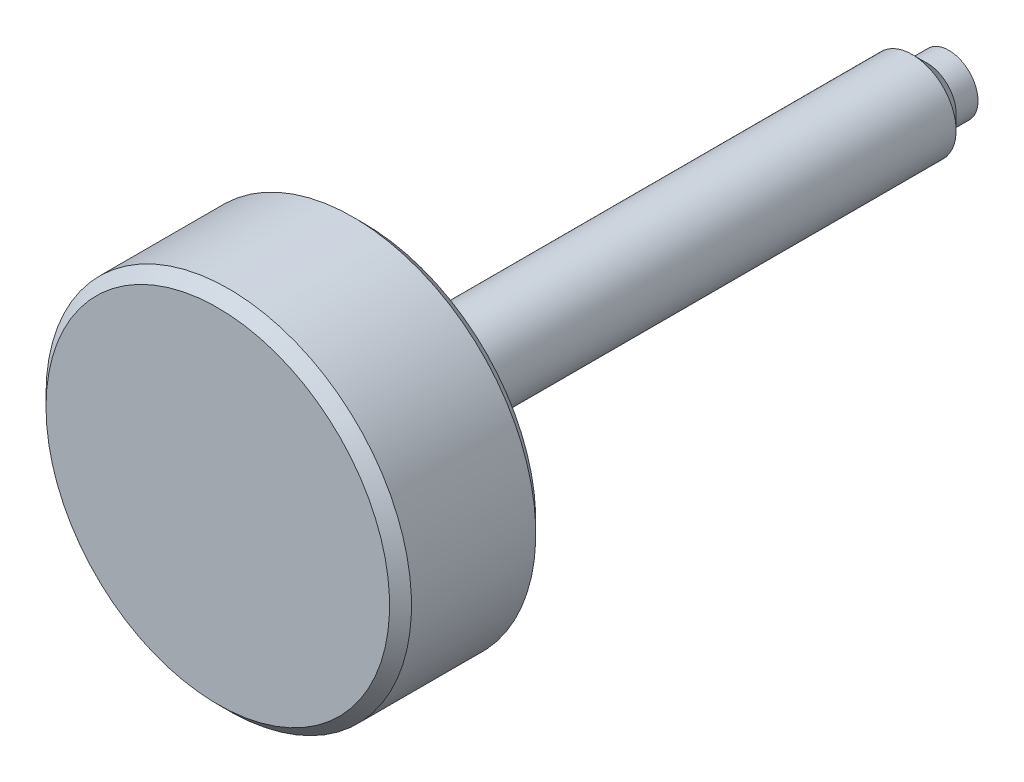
ISO-10303-21;
HEADER;
FILE_DESCRIPTION(('STEP AP214'),'2;1');
FILE_NAME('part.step','',(''),(''),'','','');
FILE_SCHEMA(('AUTOMOTIVE_DESIGN { 1 0 10303 214 1 1 1 1 }'));
ENDSEC;
DATA;
#1=APPLICATION_CONTEXT('core data for automotive mechanical design processes');
#2=APPLICATION_PROTOCOL_DEFINITION('international standard','automotive_design',2000,#1);
#3=PRODUCT_CONTEXT('',#1,'mechanical');
#4=PRODUCT('Part','Part','',(#3));
#5=PRODUCT_RELATED_PRODUCT_CATEGORY('part','',(#4));
#6=PRODUCT_DEFINITION_FORMATION('','',#4);
#7=PRODUCT_DEFINITION_CONTEXT('part definition',#1,'design');
#8=PRODUCT_DEFINITION('design','',#6,#7);
#9=PRODUCT_DEFINITION_SHAPE('','',#8);
#10=(LENGTH_UNIT() NAMED_UNIT(*) SI_UNIT(.MILLI.,.METRE.));
#11=(NAMED_UNIT(*) PLANE_ANGLE_UNIT() SI_UNIT($,.RADIAN.));
#12=(NAMED_UNIT(*) SI_UNIT($,.STERADIAN.) SOLID_ANGLE_UNIT());
#13=UNCERTAINTY_MEASURE_WITH_UNIT(LENGTH_MEASURE(1.E-05),#10,'distance_accuracy_value','');
#14=(GEOMETRIC_REPRESENTATION_CONTEXT(3) GLOBAL_UNCERTAINTY_ASSIGNED_CONTEXT((#13)) GLOBAL_UNIT_ASSIGNED_CONTEXT((#10,
#11,#12)) REPRESENTATION_CONTEXT('',''));
#15=CARTESIAN_POINT('',(0.,0.,0.));
#16=DIRECTION('',(0.,0.,1.));
#17=DIRECTION('',(1.,0.,0.));
#18=AXIS2_PLACEMENT_3D('',#15,#16,#17);
#19=CARTESIAN_POINT('',(0.,0.,50.));
#20=DIRECTION('',(0.,0.,-1.));
#21=DIRECTION('',(1.,0.,0.));
#22=AXIS2_PLACEMENT_3D('',#19,#20,#21);
#23=PLANE('',#22);
#24=CARTESIAN_POINT('',(0.,0.,50.));
#25=DIRECTION('',(0.,0.,1.));
#26=DIRECTION('',(-1.,0.,0.));
#27=AXIS2_PLACEMENT_3D('',#24,#25,#26);
#28=CIRCLE('',#27,11.75);
#29=CARTESIAN_POINT('',(-11.75,0.,50.));
#30=VERTEX_POINT('',#29);
#31=EDGE_CURVE('E8',#30,#30,#28,.T.);
#32=ORIENTED_EDGE('',*,*,#31,.T.);
#33=EDGE_LOOP('',(#32));
#34=FACE_BOUND('',#33,.T.);
#35=ADVANCED_FACE('F12',(#34),#23,.F.);
#36=CARTESIAN_POINT('',(0.,0.,49.25));
#37=DIRECTION('',(0.,0.,-1.));
#38=DIRECTION('',(1.,0.,0.));
#39=AXIS2_PLACEMENT_3D('',#36,#37,#38);
#40=CONICAL_SURFACE('',#39,12.5,0.78539816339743);
#41=ORIENTED_EDGE('',*,*,#31,.F.);
#42=EDGE_LOOP('',(#41));
#43=FACE_BOUND('',#42,.T.);
#44=CARTESIAN_POINT('',(0.,0.,49.25));
#45=DIRECTION('',(0.,0.,1.));
#46=DIRECTION('',(-1.,0.,0.));
#47=AXIS2_PLACEMENT_3D('',#44,#45,#46);
#48=CIRCLE('',#47,12.5);
#49=CARTESIAN_POINT('',(-12.5,0.,49.25));
#50=VERTEX_POINT('',#49);
#51=EDGE_CURVE('E18',#50,#50,#48,.T.);
#52=ORIENTED_EDGE('',*,*,#51,.T.);
#53=EDGE_LOOP('',(#52));
#54=FACE_BOUND('',#53,.T.);
#55=ADVANCED_FACE('F57',(#43,#54),#40,.T.);
#56=CARTESIAN_POINT('',(0.,0.,54.));
#57=DIRECTION('',(0.,0.,1.));
#58=DIRECTION('',(-1.,0.,0.));
#59=AXIS2_PLACEMENT_3D('',#56,#57,#58);
#60=CYLINDRICAL_SURFACE('',#59,12.5);
#61=ORIENTED_EDGE('',*,*,#51,.F.);
#62=EDGE_LOOP('',(#61));
#63=FACE_BOUND('',#62,.T.);
#64=CARTESIAN_POINT('',(0.,0.,40.75));
#65=DIRECTION('',(0.,0.,1.));
#66=DIRECTION('',(-1.,0.,0.));
#67=AXIS2_PLACEMENT_3D('',#64,#65,#66);
#68=CIRCLE('',#67,12.5);
#69=CARTESIAN_POINT('',(-12.5,0.,40.75));
#70=VERTEX_POINT('',#69);
#71=EDGE_CURVE('E22',#70,#70,#68,.T.);
#72=ORIENTED_EDGE('',*,*,#71,.T.);
#73=EDGE_LOOP('',(#72));
#74=FACE_BOUND('',#73,.T.);
#75=ADVANCED_FACE('F61',(#63,#74),#60,.T.);
#76=CARTESIAN_POINT('',(0.,0.,40.));
#77=DIRECTION('',(0.,0.,1.));
#78=DIRECTION('',(-1.,0.,0.));
#79=AXIS2_PLACEMENT_3D('',#76,#77,#78);
#80=CONICAL_SURFACE('',#79,11.75,0.785398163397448);
#81=ORIENTED_EDGE('',*,*,#71,.F.);
#82=EDGE_LOOP('',(#81));
#83=FACE_BOUND('',#82,.T.);
#84=CARTESIAN_POINT('',(0.,0.,40.));
#85=DIRECTION('',(0.,0.,1.));
#86=DIRECTION('',(-1.,0.,0.));
#87=AXIS2_PLACEMENT_3D('',#84,#85,#86);
#88=CIRCLE('',#87,11.75);
#89=CARTESIAN_POINT('',(-11.75,0.,40.));
#90=VERTEX_POINT('',#89);
#91=EDGE_CURVE('E26',#90,#90,#88,.T.);
#92=ORIENTED_EDGE('',*,*,#91,.T.);
#93=EDGE_LOOP('',(#92));
#94=FACE_BOUND('',#93,.T.);
#95=ADVANCED_FACE('F66',(#83,#94),#80,.T.);
#96=CARTESIAN_POINT('',(0.,-11.75,40.));
#97=DIRECTION('',(0.,0.,1.));
#98=DIRECTION('',(-1.,0.,0.));
#99=AXIS2_PLACEMENT_3D('',#96,#97,#98);
#100=PLANE('',#99);
#101=ORIENTED_EDGE('',*,*,#91,.F.);
#102=EDGE_LOOP('',(#101));
#103=FACE_BOUND('',#102,.T.);
#104=CARTESIAN_POINT('',(0.,0.,40.));
#105=DIRECTION('',(0.,0.,1.));
#106=DIRECTION('',(-1.,0.,0.));
#107=AXIS2_PLACEMENT_3D('',#104,#105,#106);
#108=CIRCLE('',#107,3.);
#109=CARTESIAN_POINT('',(-3.,0.,40.));
#110=VERTEX_POINT('',#109);
#111=EDGE_CURVE('E31',#110,#110,#108,.T.);
#112=ORIENTED_EDGE('',*,*,#111,.T.);
#113=EDGE_LOOP('',(#112));
#114=FACE_BOUND('',#113,.T.);
#115=ADVANCED_FACE('F72',(#103,#114),#100,.F.);
#116=CARTESIAN_POINT('',(0.,0.,54.));
#117=DIRECTION('',(0.,0.,1.));
#118=DIRECTION('',(-1.,0.,0.));
#119=AXIS2_PLACEMENT_3D('',#116,#117,#118);
#120=CYLINDRICAL_SURFACE('',#119,3.);
#121=ORIENTED_EDGE('',*,*,#111,.F.);
#122=EDGE_LOOP('',(#121));
#123=FACE_BOUND('',#122,.T.);
#124=CARTESIAN_POINT('',(0.,0.,2.50000000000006));
#125=DIRECTION('',(0.,0.,1.));
#126=DIRECTION('',(-1.,0.,0.));
#127=AXIS2_PLACEMENT_3D('',#124,#125,#126);
#128=CIRCLE('',#127,3.00000000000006);
#129=CARTESIAN_POINT('',(-3.00000000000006,0.,2.50000000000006));
#130=VERTEX_POINT('',#129);
#131=EDGE_CURVE('E34',#130,#130,#128,.T.);
#132=ORIENTED_EDGE('',*,*,#131,.T.);
#133=EDGE_LOOP('',(#132));
#134=FACE_BOUND('',#133,.T.);
#135=ADVANCED_FACE('F76',(#123,#134),#120,.T.);
#136=CARTESIAN_POINT('',(0.,0.,1.49999999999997));
#137=DIRECTION('',(0.,0.,1.));
#138=DIRECTION('',(-1.,0.,0.));
#139=AXIS2_PLACEMENT_3D('',#136,#137,#138);
#140=CONICAL_SURFACE('',#139,1.99999999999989,0.785398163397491);
#141=ORIENTED_EDGE('',*,*,#131,.F.);
#142=EDGE_LOOP('',(#141));
#143=FACE_BOUND('',#142,.T.);
#144=CARTESIAN_POINT('',(0.,0.,1.49999999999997));
#145=DIRECTION('',(0.,0.,1.));
#146=DIRECTION('',(-1.,0.,0.));
#147=AXIS2_PLACEMENT_3D('',#144,#145,#146);
#148=CIRCLE('',#147,1.99999999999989);
#149=CARTESIAN_POINT('',(-1.99999999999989,0.,1.49999999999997));
#150=VERTEX_POINT('',#149);
#151=EDGE_CURVE('E37',#150,#150,#148,.T.);
#152=ORIENTED_EDGE('',*,*,#151,.T.);
#153=EDGE_LOOP('',(#152));
#154=FACE_BOUND('',#153,.T.);
#155=ADVANCED_FACE('F53',(#143,#154),#140,.T.);
#156=CARTESIAN_POINT('',(0.,0.,54.));
#157=DIRECTION('',(0.,0.,1.));
#158=DIRECTION('',(-1.,0.,0.));
#159=AXIS2_PLACEMENT_3D('',#156,#157,#158);
#160=CYLINDRICAL_SURFACE('',#159,1.9999999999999);
#161=ORIENTED_EDGE('',*,*,#151,.F.);
#162=EDGE_LOOP('',(#161));
#163=FACE_BOUND('',#162,.T.);
#164=CARTESIAN_POINT('',(0.,0.,0.));
#165=DIRECTION('',(0.,0.,1.));
#166=DIRECTION('',(-1.,0.,0.));
#167=AXIS2_PLACEMENT_3D('',#164,#165,#166);
#168=CIRCLE('',#167,1.99999999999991);
#169=CARTESIAN_POINT('',(-1.99999999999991,0.,0.));
#170=VERTEX_POINT('',#169);
#171=EDGE_CURVE('E40',#170,#170,#168,.T.);
#172=ORIENTED_EDGE('',*,*,#171,.T.);
#173=EDGE_LOOP('',(#172));
#174=FACE_BOUND('',#173,.T.);
#175=ADVANCED_FACE('F44',(#163,#174),#160,.T.);
#176=CARTESIAN_POINT('',(0.,-1.99999999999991,0.));
#177=DIRECTION('',(0.,0.,1.));
#178=DIRECTION('',(-1.,0.,0.));
#179=AXIS2_PLACEMENT_3D('',#176,#177,#178);
#180=PLANE('',#179);
#181=ORIENTED_EDGE('',*,*,#171,.F.);
#182=EDGE_LOOP('',(#181));
#183=FACE_BOUND('',#182,.T.);
#184=ADVANCED_FACE('F46',(#183),#180,.F.);
#185=CLOSED_SHELL('',(#35,#55,#75,#95,#115,#135,#155,#175,#184));
#186=MANIFOLD_SOLID_BREP('B1',#185);
#187=ADVANCED_BREP_SHAPE_REPRESENTATION('',(#18,#186),#14);
#188=SHAPE_DEFINITION_REPRESENTATION(#9,#187);
ENDSEC;
END-ISO-10303-21;
